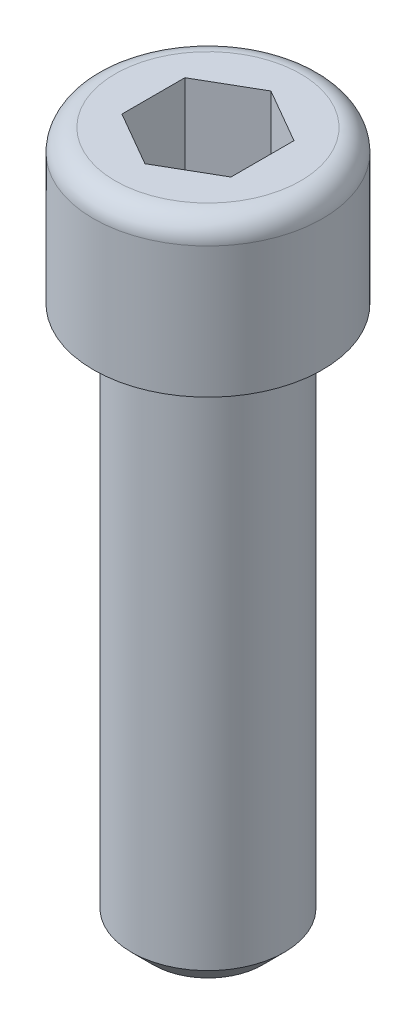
ISO-10303-21;
HEADER;
FILE_DESCRIPTION(('STEP AP214'),'2;1');
FILE_NAME('part.step','',(''),(''),'','','');
FILE_SCHEMA(('AUTOMOTIVE_DESIGN { 1 0 10303 214 1 1 1 1 }'));
ENDSEC;
DATA;
#1=APPLICATION_CONTEXT('core data for automotive mechanical design processes');
#2=APPLICATION_PROTOCOL_DEFINITION('international standard','automotive_design',2000,#1);
#3=PRODUCT_CONTEXT('',#1,'mechanical');
#4=PRODUCT('Part','Part','',(#3));
#5=PRODUCT_RELATED_PRODUCT_CATEGORY('part','',(#4));
#6=PRODUCT_DEFINITION_FORMATION('','',#4);
#7=PRODUCT_DEFINITION_CONTEXT('part definition',#1,'design');
#8=PRODUCT_DEFINITION('design','',#6,#7);
#9=PRODUCT_DEFINITION_SHAPE('','',#8);
#10=(LENGTH_UNIT() NAMED_UNIT(*) SI_UNIT(.MILLI.,.METRE.));
#11=(NAMED_UNIT(*) PLANE_ANGLE_UNIT() SI_UNIT($,.RADIAN.));
#12=(NAMED_UNIT(*) SI_UNIT($,.STERADIAN.) SOLID_ANGLE_UNIT());
#13=UNCERTAINTY_MEASURE_WITH_UNIT(LENGTH_MEASURE(1.E-05),#10,'distance_accuracy_value','');
#14=(GEOMETRIC_REPRESENTATION_CONTEXT(3) GLOBAL_UNCERTAINTY_ASSIGNED_CONTEXT((#13)) GLOBAL_UNIT_ASSIGNED_CONTEXT((#10,
#11,#12)) REPRESENTATION_CONTEXT('',''));
#15=CARTESIAN_POINT('',(0.,0.,0.));
#16=DIRECTION('',(0.,0.,1.));
#17=DIRECTION('',(1.,0.,0.));
#18=AXIS2_PLACEMENT_3D('',#15,#16,#17);
#19=CARTESIAN_POINT('',(0.,-50.,0.));
#20=DIRECTION('',(0.,1.,0.));
#21=DIRECTION('',(0.,0.,1.));
#22=AXIS2_PLACEMENT_3D('',#19,#20,#21);
#23=CYLINDRICAL_SURFACE('',#22,7.);
#24=CARTESIAN_POINT('',(0.,-48.,0.));
#25=DIRECTION('',(0.,1.,0.));
#26=DIRECTION('',(0.,0.,1.));
#27=AXIS2_PLACEMENT_3D('',#24,#25,#26);
#28=CIRCLE('',#27,7.);
#29=CARTESIAN_POINT('',(0.,-48.,7.));
#30=VERTEX_POINT('',#29);
#31=EDGE_CURVE('E38',#30,#30,#28,.T.);
#32=ORIENTED_EDGE('',*,*,#31,.T.);
#33=EDGE_LOOP('',(#32));
#34=FACE_BOUND('',#33,.T.);
#35=CARTESIAN_POINT('',(0.,0.,0.));
#36=DIRECTION('',(0.,1.,0.));
#37=DIRECTION('',(0.,0.,1.));
#38=AXIS2_PLACEMENT_3D('',#35,#36,#37);
#39=CIRCLE('',#38,7.);
#40=CARTESIAN_POINT('',(0.,0.,7.));
#41=VERTEX_POINT('',#40);
#42=EDGE_CURVE('E142',#41,#41,#39,.T.);
#43=ORIENTED_EDGE('',*,*,#42,.F.);
#44=EDGE_LOOP('',(#43));
#45=FACE_BOUND('',#44,.T.);
#46=ADVANCED_FACE('F31',(#34,#45),#23,.T.);
#47=CARTESIAN_POINT('',(0.,-50.,0.));
#48=DIRECTION('',(0.,1.,0.));
#49=DIRECTION('',(0.,0.,1.));
#50=AXIS2_PLACEMENT_3D('',#47,#48,#49);
#51=PLANE('',#50);
#52=CARTESIAN_POINT('',(0.,-50.,0.));
#53=DIRECTION('',(0.,1.,0.));
#54=DIRECTION('',(0.,0.,1.));
#55=AXIS2_PLACEMENT_3D('',#52,#53,#54);
#56=CIRCLE('',#55,4.99999999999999);
#57=CARTESIAN_POINT('',(0.,-50.,4.99999999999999));
#58=VERTEX_POINT('',#57);
#59=EDGE_CURVE('E11',#58,#58,#56,.F.);
#60=ORIENTED_EDGE('',*,*,#59,.T.);
#61=EDGE_LOOP('',(#60));
#62=FACE_BOUND('',#61,.T.);
#63=ADVANCED_FACE('F167',(#62),#51,.F.);
#64=CARTESIAN_POINT('',(0.,14.,0.));
#65=DIRECTION('',(0.,-1.,0.));
#66=DIRECTION('',(0.,0.,-1.));
#67=AXIS2_PLACEMENT_3D('',#64,#65,#66);
#68=CYLINDRICAL_SURFACE('',#67,10.5);
#69=CARTESIAN_POINT('',(0.,12.,0.));
#70=DIRECTION('',(0.,1.,0.));
#71=DIRECTION('',(0.,0.,1.));
#72=AXIS2_PLACEMENT_3D('',#69,#70,#71);
#73=CIRCLE('',#72,10.5);
#74=CARTESIAN_POINT('',(0.,12.,10.5));
#75=VERTEX_POINT('',#74);
#76=EDGE_CURVE('E148',#75,#75,#73,.F.);
#77=ORIENTED_EDGE('',*,*,#76,.T.);
#78=EDGE_LOOP('',(#77));
#79=FACE_BOUND('',#78,.T.);
#80=CARTESIAN_POINT('',(0.,0.,0.));
#81=DIRECTION('',(0.,1.,0.));
#82=DIRECTION('',(0.,0.,1.));
#83=AXIS2_PLACEMENT_3D('',#80,#81,#82);
#84=CIRCLE('',#83,10.5);
#85=CARTESIAN_POINT('',(0.,0.,10.5));
#86=VERTEX_POINT('',#85);
#87=EDGE_CURVE('E133',#86,#86,#84,.T.);
#88=ORIENTED_EDGE('',*,*,#87,.T.);
#89=EDGE_LOOP('',(#88));
#90=FACE_BOUND('',#89,.T.);
#91=ADVANCED_FACE('F171',(#79,#90),#68,.T.);
#92=CARTESIAN_POINT('',(0.,14.,0.));
#93=DIRECTION('',(0.,1.,0.));
#94=DIRECTION('',(0.,0.,1.));
#95=AXIS2_PLACEMENT_3D('',#92,#93,#94);
#96=PLANE('',#95);
#97=DIRECTION('',(0.866025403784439,0.,0.5));
#98=VECTOR('',#97,1.);
#99=CARTESIAN_POINT('',(-5.,14.,2.88675134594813));
#100=LINE('',#99,#98);
#101=CARTESIAN_POINT('',(-5.,14.,2.88675134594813));
#102=VERTEX_POINT('',#101);
#103=CARTESIAN_POINT('',(0.,14.,5.77350269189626));
#104=VERTEX_POINT('',#103);
#105=EDGE_CURVE('E45',#102,#104,#100,.T.);
#106=ORIENTED_EDGE('',*,*,#105,.F.);
#107=DIRECTION('',(0.,0.,1.));
#108=VECTOR('',#107,1.);
#109=CARTESIAN_POINT('',(-5.,14.,-2.88675134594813));
#110=LINE('',#109,#108);
#111=CARTESIAN_POINT('',(-5.,14.,-2.88675134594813));
#112=VERTEX_POINT('',#111);
#113=EDGE_CURVE('E115',#112,#102,#110,.T.);
#114=ORIENTED_EDGE('',*,*,#113,.F.);
#115=DIRECTION('',(-0.866025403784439,0.,0.5));
#116=VECTOR('',#115,1.);
#117=CARTESIAN_POINT('',(0.,14.,-5.77350269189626));
#118=LINE('',#117,#116);
#119=CARTESIAN_POINT('',(0.,14.,-5.77350269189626));
#120=VERTEX_POINT('',#119);
#121=EDGE_CURVE('E109',#120,#112,#118,.T.);
#122=ORIENTED_EDGE('',*,*,#121,.F.);
#123=DIRECTION('',(-0.866025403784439,0.,-0.5));
#124=VECTOR('',#123,1.);
#125=CARTESIAN_POINT('',(5.,14.,-2.88675134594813));
#126=LINE('',#125,#124);
#127=CARTESIAN_POINT('',(5.,14.,-2.88675134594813));
#128=VERTEX_POINT('',#127);
#129=EDGE_CURVE('E107',#128,#120,#126,.T.);
#130=ORIENTED_EDGE('',*,*,#129,.F.);
#131=DIRECTION('',(0.,0.,-1.));
#132=VECTOR('',#131,1.);
#133=CARTESIAN_POINT('',(5.,14.,2.88675134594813));
#134=LINE('',#133,#132);
#135=CARTESIAN_POINT('',(5.,14.,2.88675134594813));
#136=VERTEX_POINT('',#135);
#137=EDGE_CURVE('E88',#136,#128,#134,.T.);
#138=ORIENTED_EDGE('',*,*,#137,.F.);
#139=DIRECTION('',(0.866025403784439,0.,-0.5));
#140=VECTOR('',#139,1.);
#141=CARTESIAN_POINT('',(0.,14.,5.77350269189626));
#142=LINE('',#141,#140);
#143=EDGE_CURVE('E99',#104,#136,#142,.T.);
#144=ORIENTED_EDGE('',*,*,#143,.F.);
#145=EDGE_LOOP('',(#106,#114,#122,#130,#138,#144));
#146=FACE_BOUND('',#145,.T.);
#147=CARTESIAN_POINT('',(0.,14.,0.));
#148=DIRECTION('',(0.,1.,0.));
#149=DIRECTION('',(0.,0.,1.));
#150=AXIS2_PLACEMENT_3D('',#147,#148,#149);
#151=CIRCLE('',#150,8.5);
#152=CARTESIAN_POINT('',(0.,14.,8.5));
#153=VERTEX_POINT('',#152);
#154=EDGE_CURVE('E145',#153,#153,#151,.T.);
#155=ORIENTED_EDGE('',*,*,#154,.T.);
#156=EDGE_LOOP('',(#155));
#157=FACE_BOUND('',#156,.T.);
#158=ADVANCED_FACE('F103',(#146,#157),#96,.T.);
#159=CARTESIAN_POINT('',(0.,0.,0.));
#160=DIRECTION('',(0.,1.,0.));
#161=DIRECTION('',(0.,0.,1.));
#162=AXIS2_PLACEMENT_3D('',#159,#160,#161);
#163=PLANE('',#162);
#164=ORIENTED_EDGE('',*,*,#42,.T.);
#165=EDGE_LOOP('',(#164));
#166=FACE_BOUND('',#165,.T.);
#167=ORIENTED_EDGE('',*,*,#87,.F.);
#168=EDGE_LOOP('',(#167));
#169=FACE_BOUND('',#168,.T.);
#170=ADVANCED_FACE('F181',(#166,#169),#163,.F.);
#171=CARTESIAN_POINT('',(0.,12.,0.));
#172=DIRECTION('',(0.,1.,0.));
#173=DIRECTION('',(0.,0.,1.));
#174=AXIS2_PLACEMENT_3D('',#171,#172,#173);
#175=TOROIDAL_SURFACE('',#174,8.5,2.);
#176=ORIENTED_EDGE('',*,*,#76,.F.);
#177=EDGE_LOOP('',(#176));
#178=FACE_BOUND('',#177,.T.);
#179=ORIENTED_EDGE('',*,*,#154,.F.);
#180=EDGE_LOOP('',(#179));
#181=FACE_BOUND('',#180,.T.);
#182=ADVANCED_FACE('F184',(#178,#181),#175,.T.);
#183=CARTESIAN_POINT('',(-5.,3.,2.88675134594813));
#184=DIRECTION('',(-0.5,0.,0.866025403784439));
#185=DIRECTION('',(0.866025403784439,0.,0.5));
#186=AXIS2_PLACEMENT_3D('',#183,#184,#185);
#187=PLANE('',#186);
#188=ORIENTED_EDGE('',*,*,#105,.T.);
#189=DIRECTION('',(0.,1.,0.));
#190=VECTOR('',#189,1.);
#191=CARTESIAN_POINT('',(0.,3.,5.77350269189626));
#192=LINE('',#191,#190);
#193=CARTESIAN_POINT('',(0.,3.,5.77350269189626));
#194=VERTEX_POINT('',#193);
#195=EDGE_CURVE('E96',#194,#104,#192,.T.);
#196=ORIENTED_EDGE('',*,*,#195,.F.);
#197=DIRECTION('',(0.866025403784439,0.,0.5));
#198=VECTOR('',#197,1.);
#199=CARTESIAN_POINT('',(-5.,3.,2.88675134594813));
#200=LINE('',#199,#198);
#201=CARTESIAN_POINT('',(-5.,3.,2.88675134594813));
#202=VERTEX_POINT('',#201);
#203=EDGE_CURVE('E117',#202,#194,#200,.T.);
#204=ORIENTED_EDGE('',*,*,#203,.F.);
#205=DIRECTION('',(0.,1.,0.));
#206=VECTOR('',#205,1.);
#207=CARTESIAN_POINT('',(-5.,3.,2.88675134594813));
#208=LINE('',#207,#206);
#209=EDGE_CURVE('E52',#202,#102,#208,.T.);
#210=ORIENTED_EDGE('',*,*,#209,.T.);
#211=EDGE_LOOP('',(#188,#196,#204,#210));
#212=FACE_BOUND('',#211,.T.);
#213=ADVANCED_FACE('F188',(#212),#187,.F.);
#214=CARTESIAN_POINT('',(-5.,3.,-2.88675134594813));
#215=DIRECTION('',(-1.,0.,0.));
#216=DIRECTION('',(0.,0.,1.));
#217=AXIS2_PLACEMENT_3D('',#214,#215,#216);
#218=PLANE('',#217);
#219=ORIENTED_EDGE('',*,*,#113,.T.);
#220=ORIENTED_EDGE('',*,*,#209,.F.);
#221=DIRECTION('',(0.,0.,1.));
#222=VECTOR('',#221,1.);
#223=CARTESIAN_POINT('',(-5.,3.,-2.88675134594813));
#224=LINE('',#223,#222);
#225=CARTESIAN_POINT('',(-5.,3.,-2.88675134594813));
#226=VERTEX_POINT('',#225);
#227=EDGE_CURVE('E129',#226,#202,#224,.T.);
#228=ORIENTED_EDGE('',*,*,#227,.F.);
#229=DIRECTION('',(0.,1.,0.));
#230=VECTOR('',#229,1.);
#231=CARTESIAN_POINT('',(-5.,3.,-2.88675134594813));
#232=LINE('',#231,#230);
#233=EDGE_CURVE('E134',#226,#112,#232,.T.);
#234=ORIENTED_EDGE('',*,*,#233,.T.);
#235=EDGE_LOOP('',(#219,#220,#228,#234));
#236=FACE_BOUND('',#235,.T.);
#237=ADVANCED_FACE('F192',(#236),#218,.F.);
#238=CARTESIAN_POINT('',(0.,3.,-5.77350269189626));
#239=DIRECTION('',(-0.5,0.,-0.866025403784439));
#240=DIRECTION('',(-0.866025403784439,0.,0.5));
#241=AXIS2_PLACEMENT_3D('',#238,#239,#240);
#242=PLANE('',#241);
#243=ORIENTED_EDGE('',*,*,#121,.T.);
#244=ORIENTED_EDGE('',*,*,#233,.F.);
#245=DIRECTION('',(-0.866025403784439,0.,0.5));
#246=VECTOR('',#245,1.);
#247=CARTESIAN_POINT('',(0.,3.,-5.77350269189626));
#248=LINE('',#247,#246);
#249=CARTESIAN_POINT('',(0.,3.,-5.77350269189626));
#250=VERTEX_POINT('',#249);
#251=EDGE_CURVE('E126',#250,#226,#248,.T.);
#252=ORIENTED_EDGE('',*,*,#251,.F.);
#253=DIRECTION('',(0.,1.,0.));
#254=VECTOR('',#253,1.);
#255=CARTESIAN_POINT('',(0.,3.,-5.77350269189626));
#256=LINE('',#255,#254);
#257=EDGE_CURVE('E136',#250,#120,#256,.T.);
#258=ORIENTED_EDGE('',*,*,#257,.T.);
#259=EDGE_LOOP('',(#243,#244,#252,#258));
#260=FACE_BOUND('',#259,.T.);
#261=ADVANCED_FACE('F200',(#260),#242,.F.);
#262=CARTESIAN_POINT('',(5.,3.,-2.88675134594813));
#263=DIRECTION('',(0.5,0.,-0.866025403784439));
#264=DIRECTION('',(-0.866025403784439,0.,-0.5));
#265=AXIS2_PLACEMENT_3D('',#262,#263,#264);
#266=PLANE('',#265);
#267=ORIENTED_EDGE('',*,*,#129,.T.);
#268=ORIENTED_EDGE('',*,*,#257,.F.);
#269=DIRECTION('',(-0.866025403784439,0.,-0.5));
#270=VECTOR('',#269,1.);
#271=CARTESIAN_POINT('',(5.,3.,-2.88675134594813));
#272=LINE('',#271,#270);
#273=CARTESIAN_POINT('',(5.,3.,-2.88675134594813));
#274=VERTEX_POINT('',#273);
#275=EDGE_CURVE('E123',#274,#250,#272,.T.);
#276=ORIENTED_EDGE('',*,*,#275,.F.);
#277=DIRECTION('',(0.,1.,0.));
#278=VECTOR('',#277,1.);
#279=CARTESIAN_POINT('',(5.,3.,-2.88675134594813));
#280=LINE('',#279,#278);
#281=EDGE_CURVE('E95',#274,#128,#280,.T.);
#282=ORIENTED_EDGE('',*,*,#281,.T.);
#283=EDGE_LOOP('',(#267,#268,#276,#282));
#284=FACE_BOUND('',#283,.T.);
#285=ADVANCED_FACE('F197',(#284),#266,.F.);
#286=CARTESIAN_POINT('',(5.,3.,2.88675134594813));
#287=DIRECTION('',(1.,0.,0.));
#288=DIRECTION('',(0.,0.,-1.));
#289=AXIS2_PLACEMENT_3D('',#286,#287,#288);
#290=PLANE('',#289);
#291=ORIENTED_EDGE('',*,*,#137,.T.);
#292=ORIENTED_EDGE('',*,*,#281,.F.);
#293=DIRECTION('',(0.,0.,-1.));
#294=VECTOR('',#293,1.);
#295=CARTESIAN_POINT('',(5.,3.,2.88675134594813));
#296=LINE('',#295,#294);
#297=CARTESIAN_POINT('',(5.,3.,2.88675134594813));
#298=VERTEX_POINT('',#297);
#299=EDGE_CURVE('E91',#298,#274,#296,.T.);
#300=ORIENTED_EDGE('',*,*,#299,.F.);
#301=DIRECTION('',(0.,1.,0.));
#302=VECTOR('',#301,1.);
#303=CARTESIAN_POINT('',(5.,3.,2.88675134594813));
#304=LINE('',#303,#302);
#305=EDGE_CURVE('E84',#298,#136,#304,.T.);
#306=ORIENTED_EDGE('',*,*,#305,.T.);
#307=EDGE_LOOP('',(#291,#292,#300,#306));
#308=FACE_BOUND('',#307,.T.);
#309=ADVANCED_FACE('F86',(#308),#290,.F.);
#310=CARTESIAN_POINT('',(0.,3.,5.77350269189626));
#311=DIRECTION('',(0.5,0.,0.866025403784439));
#312=DIRECTION('',(0.866025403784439,0.,-0.5));
#313=AXIS2_PLACEMENT_3D('',#310,#311,#312);
#314=PLANE('',#313);
#315=ORIENTED_EDGE('',*,*,#143,.T.);
#316=ORIENTED_EDGE('',*,*,#305,.F.);
#317=DIRECTION('',(0.866025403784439,0.,-0.5));
#318=VECTOR('',#317,1.);
#319=CARTESIAN_POINT('',(0.,3.,5.77350269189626));
#320=LINE('',#319,#318);
#321=EDGE_CURVE('E120',#194,#298,#320,.T.);
#322=ORIENTED_EDGE('',*,*,#321,.F.);
#323=ORIENTED_EDGE('',*,*,#195,.T.);
#324=EDGE_LOOP('',(#315,#316,#322,#323));
#325=FACE_BOUND('',#324,.T.);
#326=ADVANCED_FACE('F100',(#325),#314,.F.);
#327=CARTESIAN_POINT('',(5.,3.,8.66025403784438));
#328=DIRECTION('',(0.,1.,0.));
#329=DIRECTION('',(0.,0.,1.));
#330=AXIS2_PLACEMENT_3D('',#327,#328,#329);
#331=PLANE('',#330);
#332=ORIENTED_EDGE('',*,*,#203,.T.);
#333=ORIENTED_EDGE('',*,*,#321,.T.);
#334=ORIENTED_EDGE('',*,*,#299,.T.);
#335=ORIENTED_EDGE('',*,*,#275,.T.);
#336=ORIENTED_EDGE('',*,*,#251,.T.);
#337=ORIENTED_EDGE('',*,*,#227,.T.);
#338=EDGE_LOOP('',(#332,#333,#334,#335,#336,#337));
#339=FACE_BOUND('',#338,.T.);
#340=ADVANCED_FACE('F157',(#339),#331,.T.);
#341=CARTESIAN_POINT('',(0.,-48.,0.));
#342=DIRECTION('',(0.,1.,0.));
#343=DIRECTION('',(0.,0.,1.));
#344=AXIS2_PLACEMENT_3D('',#341,#342,#343);
#345=CONICAL_SURFACE('',#344,7.,0.78539816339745);
#346=ORIENTED_EDGE('',*,*,#59,.F.);
#347=EDGE_LOOP('',(#346));
#348=FACE_BOUND('',#347,.T.);
#349=ORIENTED_EDGE('',*,*,#31,.F.);
#350=EDGE_LOOP('',(#349));
#351=FACE_BOUND('',#350,.T.);
#352=ADVANCED_FACE('F155',(#348,#351),#345,.T.);
#353=CLOSED_SHELL('',(#46,#63,#91,#158,#170,#182,#213,#237,#261,#285,#309,#326,#340,#352));
#354=MANIFOLD_SOLID_BREP('B2',#353);
#355=ADVANCED_BREP_SHAPE_REPRESENTATION('',(#18,#354),#14);
#356=SHAPE_DEFINITION_REPRESENTATION(#9,#355);
ENDSEC;
END-ISO-10303-21;
